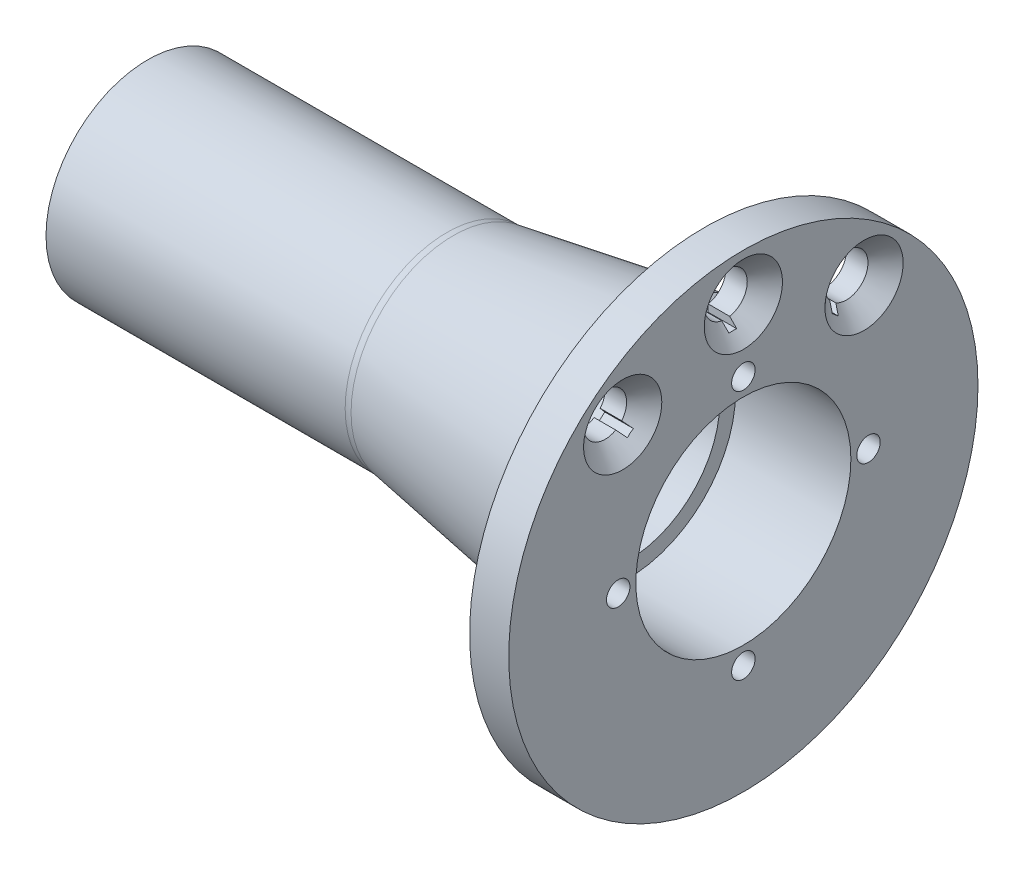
from build123d import *

# Parameters (mm, degrees)
FRAISAGE_POUR_VIS_T_TE_FRAIS_E_M101_D           = 11
FRAISAGE_POUR_VIS_T_TE_FRAIS_E_M101_CSINK_D     = 20
FRAISAGE_POUR_VIS_T_TE_FRAIS_E_M101_CSINK_ANGLE = 90
ENL_V_MAT_EXTRU_1_DEPTH                         = 166.697908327
R_P_TITION_CIRCULAIRE1_COUNT                    = 4
R_P_TITION_CIRCULAIRE2_COUNT                    = 3
R_P_TITION_CIRCULAIRE2_ANGLE                    = 80
CONG_1_R                                        = 10


with BuildPart() as part:
    # Esquisse1 → R_volution3 (revolve)
    with BuildSketch(Plane.XY, mode=Mode.PRIVATE) as r_volution3_sk:
        Polygon((0, 0), (0, 60), (-10, 60), (-10, 36), (-21, 36), (-21, 35), (-75, 26), (-152.322861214, 26), (-152.322861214, 0), align=None)
    revolve(r_volution3_sk.sketch.rotate(Axis((0, 0, 0), (-1, 0, 0)), 90), axis=Axis((0, 0, 0), (-1, 0, 0)))

    # Esquisse2 → Enl_vement de mati_re-R_volution1 (revolve, cut)
    with BuildSketch(Plane.XY, mode=Mode.PRIVATE) as enl_vement_de_mati_re_r_volution1_sk:
        Polygon((0, 0), (0, 27.5), (-29.5, 27.5), (-29.5, 23.5), (-75, 21), (-152.322861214, 21), (-152.322861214, 0), align=None)
    revolve(enl_vement_de_mati_re_r_volution1_sk.sketch.rotate(Axis((0, 0, 0), (-1, 0, 0)), 90), axis=Axis((0, 0, 0), (-1, 0, 0)), mode=Mode.SUBTRACT)

    # Esquisse3 → Trou taraud_ M6x1.03 (revolve, cut)
    with BuildSketch(Plane(origin=(0, 32, 0), x_dir=(0, 0, -1), z_dir=(0, 1, 0))):
        Polygon((0, 0), (0, 16.502151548), (2.5, 15), (2.5, 12), (3, 12), (3, 0), align=None)
    trou_taraud_m6x1_03 = revolve(axis=Axis((6.35, 32, 0), (-1, 0, 0)), mode=Mode.SUBTRACT)

    # Fraisage pour vis _ t_te frais_e M101 (through all)
    with Locations(Plane(origin=(0, 0, 0), x_dir=(0, 0, -1), z_dir=(1, 0, 0))):
        with Locations((-30.853805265, 36.77013327)):
            fraisage_pour_vis_t_te_frais_e_m101 = CounterSinkHole(FRAISAGE_POUR_VIS_T_TE_FRAIS_E_M101_D / 2, FRAISAGE_POUR_VIS_T_TE_FRAIS_E_M101_CSINK_D / 2, counter_sink_angle=FRAISAGE_POUR_VIS_T_TE_FRAIS_E_M101_CSINK_ANGLE)

    # Esquisse7 → Enl_v. mat.-Extru.1 (cut, through all)
    with BuildSketch(Plane.ZY.offset(10)):
        Polygon((30.087760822, 37.412920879), (25.427550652, 31.859098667), (26.959639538, 30.573523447), (31.619849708, 36.12734566), align=None)
    enl_v_mat_extru_1 = extrude(amount=-ENL_V_MAT_EXTRU_1_DEPTH, mode=Mode.SUBTRACT)

    # R_p_tition circulaire1: Trou taraud_ M6x1.03 ×4 about axis
    r_p_tition_circulaire1_axis = Axis((0, 0, 0), (1, 0, 0))
    for i in range(1, R_P_TITION_CIRCULAIRE1_COUNT):
        add(trou_taraud_m6x1_03.rotate(r_p_tition_circulaire1_axis, i * 360 / R_P_TITION_CIRCULAIRE1_COUNT), mode=Mode.SUBTRACT)

    # R_p_tition circulaire2: Fraisage pour vis _ t_te frais_e M101, Enl_v. mat.-Extru.1 ×3 about axis
    r_p_tition_circulaire2_axis = Axis((0, 0, 0), (-1, 0, 0))
    add([fraisage_pour_vis_t_te_frais_e_m101.rotate(r_p_tition_circulaire2_axis, i * R_P_TITION_CIRCULAIRE2_ANGLE / (R_P_TITION_CIRCULAIRE2_COUNT - 1)) for i in range(1, R_P_TITION_CIRCULAIRE2_COUNT)], mode=Mode.SUBTRACT)
    add([enl_v_mat_extru_1.rotate(r_p_tition_circulaire2_axis, i * R_P_TITION_CIRCULAIRE2_ANGLE / (R_P_TITION_CIRCULAIRE2_COUNT - 1)) for i in range(1, R_P_TITION_CIRCULAIRE2_COUNT)], mode=Mode.SUBTRACT)

    # Cong_1
    cong_1_edges = [part.edges().sort_by_distance(p)[0] for p in [
        (-75, 0, 26),
    ]]
    fillet(cong_1_edges, radius=CONG_1_R)


solid = part.part
